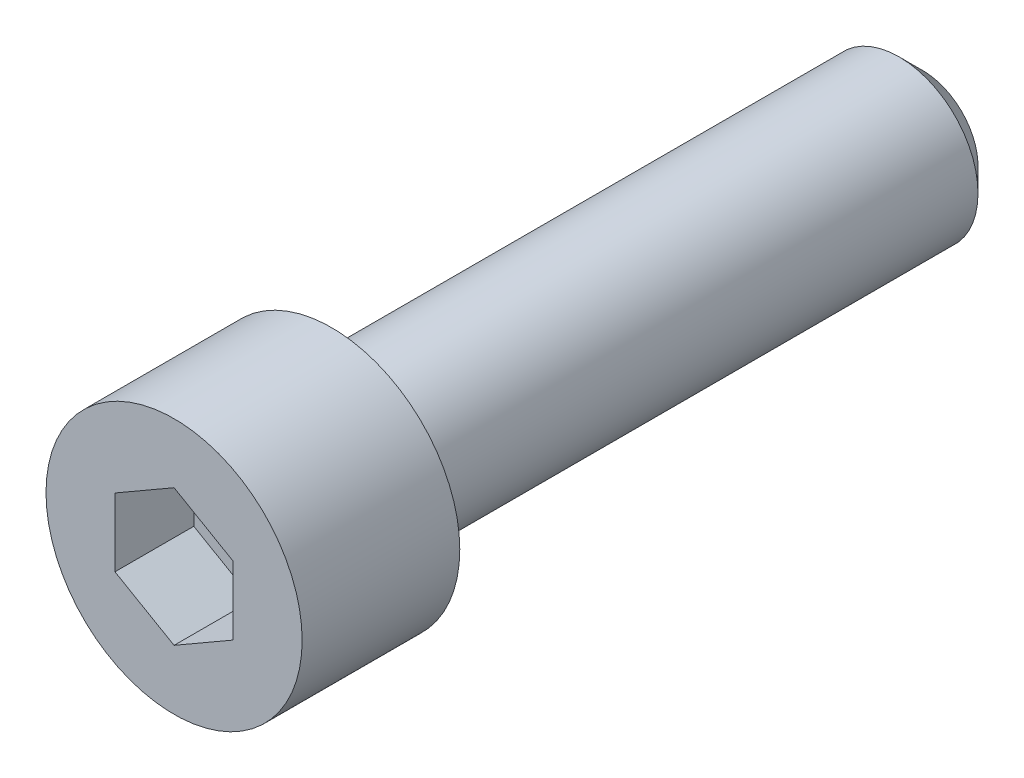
ISO-10303-21;
HEADER;
FILE_DESCRIPTION(('STEP AP214'),'2;1');
FILE_NAME('part.step','',(''),(''),'','','');
FILE_SCHEMA(('AUTOMOTIVE_DESIGN { 1 0 10303 214 1 1 1 1 }'));
ENDSEC;
DATA;
#1=APPLICATION_CONTEXT('core data for automotive mechanical design processes');
#2=APPLICATION_PROTOCOL_DEFINITION('international standard','automotive_design',2000,#1);
#3=PRODUCT_CONTEXT('',#1,'mechanical');
#4=PRODUCT('Part','Part','',(#3));
#5=PRODUCT_RELATED_PRODUCT_CATEGORY('part','',(#4));
#6=PRODUCT_DEFINITION_FORMATION('','',#4);
#7=PRODUCT_DEFINITION_CONTEXT('part definition',#1,'design');
#8=PRODUCT_DEFINITION('design','',#6,#7);
#9=PRODUCT_DEFINITION_SHAPE('','',#8);
#10=(LENGTH_UNIT() NAMED_UNIT(*) SI_UNIT(.MILLI.,.METRE.));
#11=(NAMED_UNIT(*) PLANE_ANGLE_UNIT() SI_UNIT($,.RADIAN.));
#12=(NAMED_UNIT(*) SI_UNIT($,.STERADIAN.) SOLID_ANGLE_UNIT());
#13=UNCERTAINTY_MEASURE_WITH_UNIT(LENGTH_MEASURE(1.E-05),#10,'distance_accuracy_value','');
#14=(GEOMETRIC_REPRESENTATION_CONTEXT(3) GLOBAL_UNCERTAINTY_ASSIGNED_CONTEXT((#13)) GLOBAL_UNIT_ASSIGNED_CONTEXT((#10,
#11,#12)) REPRESENTATION_CONTEXT('',''));
#15=CARTESIAN_POINT('',(0.,0.,0.));
#16=DIRECTION('',(0.,0.,1.));
#17=DIRECTION('',(1.,0.,0.));
#18=AXIS2_PLACEMENT_3D('',#15,#16,#17);
#19=CARTESIAN_POINT('',(0.,3.46410161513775,4.));
#20=DIRECTION('',(-0.5,-0.86602540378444,0.));
#21=DIRECTION('',(0.86602540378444,-0.5,0.));
#22=AXIS2_PLACEMENT_3D('',#19,#20,#21);
#23=PLANE('',#22);
#24=DIRECTION('',(0.,0.,1.));
#25=VECTOR('',#24,1.);
#26=CARTESIAN_POINT('',(3.,1.73205080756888,4.));
#27=LINE('',#26,#25);
#28=CARTESIAN_POINT('',(3.,1.73205080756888,4.));
#29=VERTEX_POINT('',#28);
#30=CARTESIAN_POINT('',(3.,1.73205080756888,8.));
#31=VERTEX_POINT('',#30);
#32=EDGE_CURVE('E63',#29,#31,#27,.T.);
#33=ORIENTED_EDGE('',*,*,#32,.T.);
#34=DIRECTION('',(0.86602540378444,-0.5,0.));
#35=VECTOR('',#34,1.);
#36=CARTESIAN_POINT('',(0.,3.46410161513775,8.));
#37=LINE('',#36,#35);
#38=CARTESIAN_POINT('',(0.,3.46410161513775,8.));
#39=VERTEX_POINT('',#38);
#40=EDGE_CURVE('E29',#39,#31,#37,.T.);
#41=ORIENTED_EDGE('',*,*,#40,.F.);
#42=DIRECTION('',(0.,0.,1.));
#43=VECTOR('',#42,1.);
#44=CARTESIAN_POINT('',(0.,3.46410161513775,4.));
#45=LINE('',#44,#43);
#46=CARTESIAN_POINT('',(0.,3.46410161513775,4.));
#47=VERTEX_POINT('',#46);
#48=EDGE_CURVE('E33',#47,#39,#45,.T.);
#49=ORIENTED_EDGE('',*,*,#48,.F.);
#50=DIRECTION('',(0.86602540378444,-0.5,0.));
#51=VECTOR('',#50,1.);
#52=CARTESIAN_POINT('',(0.,3.46410161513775,4.));
#53=LINE('',#52,#51);
#54=EDGE_CURVE('E65',#47,#29,#53,.T.);
#55=ORIENTED_EDGE('',*,*,#54,.T.);
#56=EDGE_LOOP('',(#33,#41,#49,#55));
#57=FACE_BOUND('',#56,.T.);
#58=ADVANCED_FACE('F14',(#57),#23,.T.);
#59=CARTESIAN_POINT('',(3.,-1.73205080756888,4.));
#60=DIRECTION('',(1.,0.,0.));
#61=DIRECTION('',(0.,0.,-1.));
#62=AXIS2_PLACEMENT_3D('',#59,#60,#61);
#63=PLANE('',#62);
#64=DIRECTION('',(0.,0.,1.));
#65=VECTOR('',#64,1.);
#66=CARTESIAN_POINT('',(3.,-1.73205080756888,4.));
#67=LINE('',#66,#65);
#68=CARTESIAN_POINT('',(3.,-1.73205080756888,4.));
#69=VERTEX_POINT('',#68);
#70=CARTESIAN_POINT('',(3.,-1.73205080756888,8.));
#71=VERTEX_POINT('',#70);
#72=EDGE_CURVE('E70',#69,#71,#67,.T.);
#73=ORIENTED_EDGE('',*,*,#72,.T.);
#74=DIRECTION('',(0.,1.,0.));
#75=VECTOR('',#74,1.);
#76=CARTESIAN_POINT('',(3.,-1.73205080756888,8.));
#77=LINE('',#76,#75);
#78=EDGE_CURVE('E73',#71,#31,#77,.T.);
#79=ORIENTED_EDGE('',*,*,#78,.T.);
#80=ORIENTED_EDGE('',*,*,#32,.F.);
#81=DIRECTION('',(0.,1.,0.));
#82=VECTOR('',#81,1.);
#83=CARTESIAN_POINT('',(3.,-1.73205080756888,4.));
#84=LINE('',#83,#82);
#85=EDGE_CURVE('E100',#69,#29,#84,.T.);
#86=ORIENTED_EDGE('',*,*,#85,.F.);
#87=EDGE_LOOP('',(#73,#79,#80,#86));
#88=FACE_BOUND('',#87,.T.);
#89=ADVANCED_FACE('F74',(#88),#63,.F.);
#90=CARTESIAN_POINT('',(0.,-3.46410161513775,4.));
#91=DIRECTION('',(0.5,-0.86602540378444,0.));
#92=DIRECTION('',(0.86602540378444,0.5,0.));
#93=AXIS2_PLACEMENT_3D('',#90,#91,#92);
#94=PLANE('',#93);
#95=DIRECTION('',(0.,0.,1.));
#96=VECTOR('',#95,1.);
#97=CARTESIAN_POINT('',(0.,-3.46410161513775,4.));
#98=LINE('',#97,#96);
#99=CARTESIAN_POINT('',(0.,-3.46410161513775,4.));
#100=VERTEX_POINT('',#99);
#101=CARTESIAN_POINT('',(0.,-3.46410161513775,8.));
#102=VERTEX_POINT('',#101);
#103=EDGE_CURVE('E108',#100,#102,#98,.T.);
#104=ORIENTED_EDGE('',*,*,#103,.T.);
#105=DIRECTION('',(0.86602540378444,0.5,0.));
#106=VECTOR('',#105,1.);
#107=CARTESIAN_POINT('',(0.,-3.46410161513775,8.));
#108=LINE('',#107,#106);
#109=EDGE_CURVE('E78',#102,#71,#108,.T.);
#110=ORIENTED_EDGE('',*,*,#109,.T.);
#111=ORIENTED_EDGE('',*,*,#72,.F.);
#112=DIRECTION('',(0.86602540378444,0.5,0.));
#113=VECTOR('',#112,1.);
#114=CARTESIAN_POINT('',(0.,-3.46410161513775,4.));
#115=LINE('',#114,#113);
#116=EDGE_CURVE('E97',#100,#69,#115,.T.);
#117=ORIENTED_EDGE('',*,*,#116,.F.);
#118=EDGE_LOOP('',(#104,#110,#111,#117));
#119=FACE_BOUND('',#118,.T.);
#120=ADVANCED_FACE('F141',(#119),#94,.F.);
#121=CARTESIAN_POINT('',(0.,-3.46410161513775,4.));
#122=DIRECTION('',(0.5,0.86602540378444,0.));
#123=DIRECTION('',(-0.86602540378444,0.5,0.));
#124=AXIS2_PLACEMENT_3D('',#121,#122,#123);
#125=PLANE('',#124);
#126=DIRECTION('',(0.,0.,1.));
#127=VECTOR('',#126,1.);
#128=CARTESIAN_POINT('',(-3.,-1.73205080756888,4.));
#129=LINE('',#128,#127);
#130=CARTESIAN_POINT('',(-3.,-1.73205080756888,4.));
#131=VERTEX_POINT('',#130);
#132=CARTESIAN_POINT('',(-3.,-1.73205080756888,8.));
#133=VERTEX_POINT('',#132);
#134=EDGE_CURVE('E106',#131,#133,#129,.T.);
#135=ORIENTED_EDGE('',*,*,#134,.T.);
#136=DIRECTION('',(-0.86602540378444,0.5,0.));
#137=VECTOR('',#136,1.);
#138=CARTESIAN_POINT('',(0.,-3.46410161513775,8.));
#139=LINE('',#138,#137);
#140=EDGE_CURVE('E189',#102,#133,#139,.T.);
#141=ORIENTED_EDGE('',*,*,#140,.F.);
#142=ORIENTED_EDGE('',*,*,#103,.F.);
#143=DIRECTION('',(-0.86602540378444,0.5,0.));
#144=VECTOR('',#143,1.);
#145=CARTESIAN_POINT('',(0.,-3.46410161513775,4.));
#146=LINE('',#145,#144);
#147=EDGE_CURVE('E94',#100,#131,#146,.T.);
#148=ORIENTED_EDGE('',*,*,#147,.T.);
#149=EDGE_LOOP('',(#135,#141,#142,#148));
#150=FACE_BOUND('',#149,.T.);
#151=ADVANCED_FACE('F153',(#150),#125,.T.);
#152=CARTESIAN_POINT('',(-3.,1.73205080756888,4.));
#153=DIRECTION('',(-1.,0.,0.));
#154=DIRECTION('',(0.,-1.,0.));
#155=AXIS2_PLACEMENT_3D('',#152,#153,#154);
#156=PLANE('',#155);
#157=DIRECTION('',(0.,0.,1.));
#158=VECTOR('',#157,1.);
#159=CARTESIAN_POINT('',(-3.,1.73205080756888,4.));
#160=LINE('',#159,#158);
#161=CARTESIAN_POINT('',(-3.,1.73205080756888,4.));
#162=VERTEX_POINT('',#161);
#163=CARTESIAN_POINT('',(-3.,1.73205080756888,8.));
#164=VERTEX_POINT('',#163);
#165=EDGE_CURVE('E104',#162,#164,#160,.T.);
#166=ORIENTED_EDGE('',*,*,#165,.T.);
#167=DIRECTION('',(0.,-1.,0.));
#168=VECTOR('',#167,1.);
#169=CARTESIAN_POINT('',(-3.,1.73205080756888,8.));
#170=LINE('',#169,#168);
#171=EDGE_CURVE('E190',#164,#133,#170,.T.);
#172=ORIENTED_EDGE('',*,*,#171,.T.);
#173=ORIENTED_EDGE('',*,*,#134,.F.);
#174=DIRECTION('',(0.,-1.,0.));
#175=VECTOR('',#174,1.);
#176=CARTESIAN_POINT('',(-3.,1.73205080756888,4.));
#177=LINE('',#176,#175);
#178=EDGE_CURVE('E91',#162,#131,#177,.T.);
#179=ORIENTED_EDGE('',*,*,#178,.F.);
#180=EDGE_LOOP('',(#166,#172,#173,#179));
#181=FACE_BOUND('',#180,.T.);
#182=ADVANCED_FACE('F149',(#181),#156,.F.);
#183=CARTESIAN_POINT('',(0.,3.46410161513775,4.));
#184=DIRECTION('',(-0.5,0.86602540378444,0.));
#185=DIRECTION('',(-0.86602540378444,-0.5,0.));
#186=AXIS2_PLACEMENT_3D('',#183,#184,#185);
#187=PLANE('',#186);
#188=DIRECTION('',(-0.86602540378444,-0.5,0.));
#189=VECTOR('',#188,1.);
#190=CARTESIAN_POINT('',(0.,3.46410161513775,4.));
#191=LINE('',#190,#189);
#192=EDGE_CURVE('E88',#47,#162,#191,.T.);
#193=ORIENTED_EDGE('',*,*,#192,.F.);
#194=ORIENTED_EDGE('',*,*,#48,.T.);
#195=DIRECTION('',(-0.86602540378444,-0.5,0.));
#196=VECTOR('',#195,1.);
#197=CARTESIAN_POINT('',(0.,3.46410161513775,8.));
#198=LINE('',#197,#196);
#199=EDGE_CURVE('E84',#39,#164,#198,.T.);
#200=ORIENTED_EDGE('',*,*,#199,.T.);
#201=ORIENTED_EDGE('',*,*,#165,.F.);
#202=EDGE_LOOP('',(#193,#194,#200,#201));
#203=FACE_BOUND('',#202,.T.);
#204=ADVANCED_FACE('F146',(#203),#187,.F.);
#205=CARTESIAN_POINT('',(-3.,5.19615242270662,4.));
#206=DIRECTION('',(0.,0.,-1.));
#207=DIRECTION('',(-1.,0.,0.));
#208=AXIS2_PLACEMENT_3D('',#205,#206,#207);
#209=PLANE('',#208);
#210=ORIENTED_EDGE('',*,*,#54,.F.);
#211=ORIENTED_EDGE('',*,*,#192,.T.);
#212=ORIENTED_EDGE('',*,*,#178,.T.);
#213=ORIENTED_EDGE('',*,*,#147,.F.);
#214=ORIENTED_EDGE('',*,*,#116,.T.);
#215=ORIENTED_EDGE('',*,*,#85,.T.);
#216=EDGE_LOOP('',(#210,#211,#212,#213,#214,#215));
#217=FACE_BOUND('',#216,.T.);
#218=ADVANCED_FACE('F145',(#217),#209,.F.);
#219=CARTESIAN_POINT('',(0.,0.,8.));
#220=DIRECTION('',(0.,0.,1.));
#221=DIRECTION('',(1.,0.,0.));
#222=AXIS2_PLACEMENT_3D('',#219,#220,#221);
#223=PLANE('',#222);
#224=CARTESIAN_POINT('',(0.,0.,8.));
#225=DIRECTION('',(0.,0.,1.));
#226=DIRECTION('',(1.,0.,0.));
#227=AXIS2_PLACEMENT_3D('',#224,#225,#226);
#228=CIRCLE('',#227,6.5);
#229=CARTESIAN_POINT('',(6.5,0.,8.));
#230=VERTEX_POINT('',#229);
#231=EDGE_CURVE('E116',#230,#230,#228,.T.);
#232=ORIENTED_EDGE('',*,*,#231,.T.);
#233=EDGE_LOOP('',(#232));
#234=FACE_BOUND('',#233,.T.);
#235=ORIENTED_EDGE('',*,*,#199,.F.);
#236=ORIENTED_EDGE('',*,*,#40,.T.);
#237=ORIENTED_EDGE('',*,*,#78,.F.);
#238=ORIENTED_EDGE('',*,*,#109,.F.);
#239=ORIENTED_EDGE('',*,*,#140,.T.);
#240=ORIENTED_EDGE('',*,*,#171,.F.);
#241=EDGE_LOOP('',(#235,#236,#237,#238,#239,#240));
#242=FACE_BOUND('',#241,.T.);
#243=ADVANCED_FACE('F81',(#234,#242),#223,.T.);
#244=CARTESIAN_POINT('',(0.,0.,-10.));
#245=DIRECTION('',(0.,0.,1.));
#246=DIRECTION('',(1.,0.,0.));
#247=AXIS2_PLACEMENT_3D('',#244,#245,#246);
#248=CYLINDRICAL_SURFACE('',#247,6.5);
#249=CARTESIAN_POINT('',(0.,0.,0.));
#250=DIRECTION('',(0.,0.,1.));
#251=DIRECTION('',(1.,0.,0.));
#252=AXIS2_PLACEMENT_3D('',#249,#250,#251);
#253=CIRCLE('',#252,6.5);
#254=CARTESIAN_POINT('',(6.5,0.,0.));
#255=VERTEX_POINT('',#254);
#256=EDGE_CURVE('E113',#255,#255,#253,.T.);
#257=ORIENTED_EDGE('',*,*,#256,.T.);
#258=EDGE_LOOP('',(#257));
#259=FACE_BOUND('',#258,.T.);
#260=ORIENTED_EDGE('',*,*,#231,.F.);
#261=EDGE_LOOP('',(#260));
#262=FACE_BOUND('',#261,.T.);
#263=ADVANCED_FACE('F166',(#259,#262),#248,.T.);
#264=CARTESIAN_POINT('',(6.5,0.,0.));
#265=DIRECTION('',(0.,0.,-1.));
#266=DIRECTION('',(-1.,0.,0.));
#267=AXIS2_PLACEMENT_3D('',#264,#265,#266);
#268=PLANE('',#267);
#269=CARTESIAN_POINT('',(0.,0.,0.));
#270=DIRECTION('',(0.,0.,1.));
#271=DIRECTION('',(1.,0.,0.));
#272=AXIS2_PLACEMENT_3D('',#269,#270,#271);
#273=CIRCLE('',#272,4.);
#274=CARTESIAN_POINT('',(4.,0.,0.));
#275=VERTEX_POINT('',#274);
#276=EDGE_CURVE('E69',#275,#275,#273,.T.);
#277=ORIENTED_EDGE('',*,*,#276,.T.);
#278=EDGE_LOOP('',(#277));
#279=FACE_BOUND('',#278,.T.);
#280=ORIENTED_EDGE('',*,*,#256,.F.);
#281=EDGE_LOOP('',(#280));
#282=FACE_BOUND('',#281,.T.);
#283=ADVANCED_FACE('F163',(#279,#282),#268,.T.);
#284=CARTESIAN_POINT('',(0.,0.,-10.));
#285=DIRECTION('',(0.,0.,1.));
#286=DIRECTION('',(1.,0.,0.));
#287=AXIS2_PLACEMENT_3D('',#284,#285,#286);
#288=CYLINDRICAL_SURFACE('',#287,4.);
#289=CARTESIAN_POINT('',(0.,0.,-28.8));
#290=DIRECTION('',(0.,0.,-1.));
#291=DIRECTION('',(-1.,0.,0.));
#292=AXIS2_PLACEMENT_3D('',#289,#290,#291);
#293=CIRCLE('',#292,4.);
#294=CARTESIAN_POINT('',(-4.,0.,-28.8));
#295=VERTEX_POINT('',#294);
#296=EDGE_CURVE('E22',#295,#295,#293,.F.);
#297=ORIENTED_EDGE('',*,*,#296,.T.);
#298=EDGE_LOOP('',(#297));
#299=FACE_BOUND('',#298,.T.);
#300=ORIENTED_EDGE('',*,*,#276,.F.);
#301=EDGE_LOOP('',(#300));
#302=FACE_BOUND('',#301,.T.);
#303=ADVANCED_FACE('F121',(#299,#302),#288,.T.);
#304=CARTESIAN_POINT('',(4.,0.,-30.));
#305=DIRECTION('',(0.,0.,-1.));
#306=DIRECTION('',(-1.,0.,0.));
#307=AXIS2_PLACEMENT_3D('',#304,#305,#306);
#308=PLANE('',#307);
#309=CARTESIAN_POINT('',(0.,0.,-30.));
#310=DIRECTION('',(0.,0.,-1.));
#311=DIRECTION('',(-1.,0.,0.));
#312=AXIS2_PLACEMENT_3D('',#309,#310,#311);
#313=CIRCLE('',#312,2.8);
#314=CARTESIAN_POINT('',(-2.8,0.,-30.));
#315=VERTEX_POINT('',#314);
#316=EDGE_CURVE('E9',#315,#315,#313,.T.);
#317=ORIENTED_EDGE('',*,*,#316,.T.);
#318=EDGE_LOOP('',(#317));
#319=FACE_BOUND('',#318,.T.);
#320=ADVANCED_FACE('F125',(#319),#308,.T.);
#321=CARTESIAN_POINT('',(0.,0.,-28.8));
#322=DIRECTION('',(0.,0.,1.));
#323=DIRECTION('',(1.,0.,0.));
#324=AXIS2_PLACEMENT_3D('',#321,#322,#323);
#325=CONICAL_SURFACE('',#324,4.,0.785398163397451);
#326=ORIENTED_EDGE('',*,*,#316,.F.);
#327=EDGE_LOOP('',(#326));
#328=FACE_BOUND('',#327,.T.);
#329=ORIENTED_EDGE('',*,*,#296,.F.);
#330=EDGE_LOOP('',(#329));
#331=FACE_BOUND('',#330,.T.);
#332=ADVANCED_FACE('F16',(#328,#331),#325,.T.);
#333=CLOSED_SHELL('',(#58,#89,#120,#151,#182,#204,#218,#243,#263,#283,#303,#320,#332));
#334=MANIFOLD_SOLID_BREP('B1',#333);
#335=ADVANCED_BREP_SHAPE_REPRESENTATION('',(#18,#334),#14);
#336=SHAPE_DEFINITION_REPRESENTATION(#9,#335);
ENDSEC;
END-ISO-10303-21;
